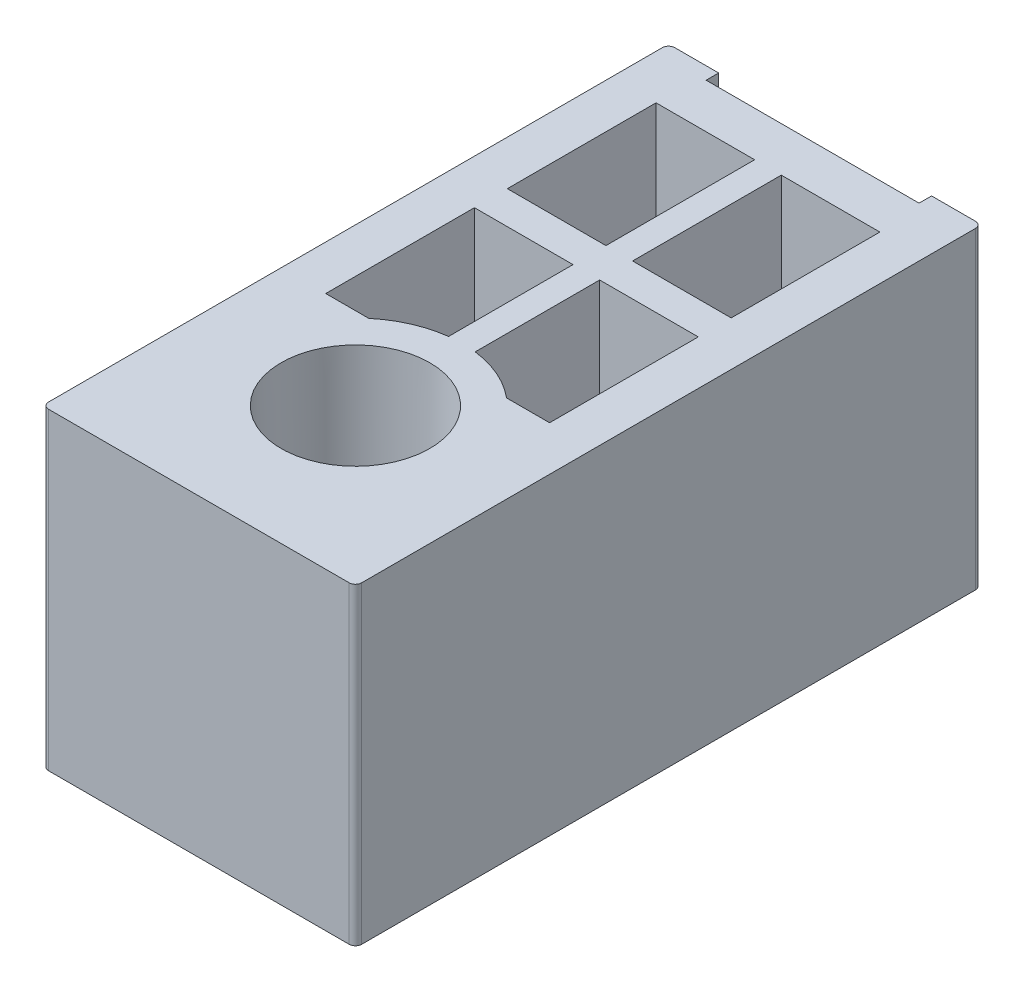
ISO-10303-21;
HEADER;
FILE_DESCRIPTION(('STEP AP214'),'2;1');
FILE_NAME('part.step','',(''),(''),'','','');
FILE_SCHEMA(('AUTOMOTIVE_DESIGN { 1 0 10303 214 1 1 1 1 }'));
ENDSEC;
DATA;
#1=APPLICATION_CONTEXT('core data for automotive mechanical design processes');
#2=APPLICATION_PROTOCOL_DEFINITION('international standard','automotive_design',2000,#1);
#3=PRODUCT_CONTEXT('',#1,'mechanical');
#4=PRODUCT('Part','Part','',(#3));
#5=PRODUCT_RELATED_PRODUCT_CATEGORY('part','',(#4));
#6=PRODUCT_DEFINITION_FORMATION('','',#4);
#7=PRODUCT_DEFINITION_CONTEXT('part definition',#1,'design');
#8=PRODUCT_DEFINITION('design','',#6,#7);
#9=PRODUCT_DEFINITION_SHAPE('','',#8);
#10=(LENGTH_UNIT() NAMED_UNIT(*) SI_UNIT(.MILLI.,.METRE.));
#11=(NAMED_UNIT(*) PLANE_ANGLE_UNIT() SI_UNIT($,.RADIAN.));
#12=(NAMED_UNIT(*) SI_UNIT($,.STERADIAN.) SOLID_ANGLE_UNIT());
#13=UNCERTAINTY_MEASURE_WITH_UNIT(LENGTH_MEASURE(1.E-05),#10,'distance_accuracy_value','');
#14=(GEOMETRIC_REPRESENTATION_CONTEXT(3) GLOBAL_UNCERTAINTY_ASSIGNED_CONTEXT((#13)) GLOBAL_UNIT_ASSIGNED_CONTEXT((#10,
#11,#12)) REPRESENTATION_CONTEXT('',''));
#15=CARTESIAN_POINT('',(0.,0.,0.));
#16=DIRECTION('',(0.,0.,1.));
#17=DIRECTION('',(1.,0.,0.));
#18=AXIS2_PLACEMENT_3D('',#15,#16,#17);
#19=CARTESIAN_POINT('',(4.,25.,-49.));
#20=DIRECTION('',(-1.,0.,0.));
#21=DIRECTION('',(0.,0.,1.));
#22=AXIS2_PLACEMENT_3D('',#19,#20,#21);
#23=PLANE('',#22);
#24=DIRECTION('',(0.,0.,-1.));
#25=VECTOR('',#24,1.);
#26=CARTESIAN_POINT('',(4.,0.,-49.));
#27=LINE('',#26,#25);
#28=CARTESIAN_POINT('',(4.,0.,-49.));
#29=VERTEX_POINT('',#28);
#30=CARTESIAN_POINT('',(4.,0.,-50.));
#31=VERTEX_POINT('',#30);
#32=EDGE_CURVE('E437',#29,#31,#27,.T.);
#33=ORIENTED_EDGE('',*,*,#32,.T.);
#34=DIRECTION('',(0.,-1.,0.));
#35=VECTOR('',#34,1.);
#36=CARTESIAN_POINT('',(4.,25.,-50.));
#37=LINE('',#36,#35);
#38=CARTESIAN_POINT('',(4.,25.,-50.));
#39=VERTEX_POINT('',#38);
#40=EDGE_CURVE('E11',#39,#31,#37,.T.);
#41=ORIENTED_EDGE('',*,*,#40,.F.);
#42=DIRECTION('',(0.,0.,-1.));
#43=VECTOR('',#42,1.);
#44=CARTESIAN_POINT('',(4.,25.,-49.));
#45=LINE('',#44,#43);
#46=CARTESIAN_POINT('',(4.,25.,-49.));
#47=VERTEX_POINT('',#46);
#48=EDGE_CURVE('E466',#47,#39,#45,.T.);
#49=ORIENTED_EDGE('',*,*,#48,.F.);
#50=DIRECTION('',(0.,-1.,0.));
#51=VECTOR('',#50,1.);
#52=CARTESIAN_POINT('',(4.,25.,-49.));
#53=LINE('',#52,#51);
#54=EDGE_CURVE('E490',#47,#29,#53,.T.);
#55=ORIENTED_EDGE('',*,*,#54,.T.);
#56=EDGE_LOOP('',(#33,#41,#49,#55));
#57=FACE_BOUND('',#56,.T.);
#58=ADVANCED_FACE('F26',(#57),#23,.F.);
#59=CARTESIAN_POINT('',(0.500000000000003,25.,-50.));
#60=DIRECTION('',(0.,0.,1.));
#61=DIRECTION('',(1.,0.,0.));
#62=AXIS2_PLACEMENT_3D('',#59,#60,#61);
#63=PLANE('',#62);
#64=DIRECTION('',(-1.,0.,0.));
#65=VECTOR('',#64,1.);
#66=CARTESIAN_POINT('',(0.500000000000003,0.,-50.));
#67=LINE('',#66,#65);
#68=CARTESIAN_POINT('',(0.500000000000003,0.,-50.));
#69=VERTEX_POINT('',#68);
#70=EDGE_CURVE('E428',#31,#69,#67,.T.);
#71=ORIENTED_EDGE('',*,*,#70,.T.);
#72=DIRECTION('',(0.,-1.,0.));
#73=VECTOR('',#72,1.);
#74=CARTESIAN_POINT('',(0.500000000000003,25.,-50.));
#75=LINE('',#74,#73);
#76=CARTESIAN_POINT('',(0.500000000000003,25.,-50.));
#77=VERTEX_POINT('',#76);
#78=EDGE_CURVE('E33',#77,#69,#75,.T.);
#79=ORIENTED_EDGE('',*,*,#78,.F.);
#80=DIRECTION('',(-1.,0.,0.));
#81=VECTOR('',#80,1.);
#82=CARTESIAN_POINT('',(0.500000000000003,25.,-50.));
#83=LINE('',#82,#81);
#84=EDGE_CURVE('E469',#39,#77,#83,.T.);
#85=ORIENTED_EDGE('',*,*,#84,.F.);
#86=ORIENTED_EDGE('',*,*,#40,.T.);
#87=EDGE_LOOP('',(#71,#79,#85,#86));
#88=FACE_BOUND('',#87,.T.);
#89=ADVANCED_FACE('F419',(#88),#63,.F.);
#90=CARTESIAN_POINT('',(0.5,25.,-49.5));
#91=DIRECTION('',(0.,-1.,0.));
#92=DIRECTION('',(0.,0.,-1.));
#93=AXIS2_PLACEMENT_3D('',#90,#91,#92);
#94=CYLINDRICAL_SURFACE('',#93,0.5);
#95=CARTESIAN_POINT('',(0.5,0.,-49.5));
#96=DIRECTION('',(0.,1.,0.));
#97=DIRECTION('',(0.,0.,1.));
#98=AXIS2_PLACEMENT_3D('',#95,#96,#97);
#99=CIRCLE('',#98,0.5);
#100=CARTESIAN_POINT('',(0.,0.,-49.5));
#101=VERTEX_POINT('',#100);
#102=EDGE_CURVE('E436',#69,#101,#99,.T.);
#103=ORIENTED_EDGE('',*,*,#102,.T.);
#104=DIRECTION('',(0.,-1.,0.));
#105=VECTOR('',#104,1.);
#106=CARTESIAN_POINT('',(0.,25.,-49.5));
#107=LINE('',#106,#105);
#108=CARTESIAN_POINT('',(0.,25.,-49.5));
#109=VERTEX_POINT('',#108);
#110=EDGE_CURVE('E442',#109,#101,#107,.T.);
#111=ORIENTED_EDGE('',*,*,#110,.F.);
#112=CARTESIAN_POINT('',(0.5,25.,-49.5));
#113=DIRECTION('',(0.,1.,0.));
#114=DIRECTION('',(0.,0.,1.));
#115=AXIS2_PLACEMENT_3D('',#112,#113,#114);
#116=CIRCLE('',#115,0.5);
#117=EDGE_CURVE('E441',#77,#109,#116,.T.);
#118=ORIENTED_EDGE('',*,*,#117,.F.);
#119=ORIENTED_EDGE('',*,*,#78,.T.);
#120=EDGE_LOOP('',(#103,#111,#118,#119));
#121=FACE_BOUND('',#120,.T.);
#122=ADVANCED_FACE('F416',(#121),#94,.T.);
#123=CARTESIAN_POINT('',(0.,25.,-49.5));
#124=DIRECTION('',(1.,0.,0.));
#125=DIRECTION('',(0.,0.,-1.));
#126=AXIS2_PLACEMENT_3D('',#123,#124,#125);
#127=PLANE('',#126);
#128=DIRECTION('',(0.,0.,1.));
#129=VECTOR('',#128,1.);
#130=CARTESIAN_POINT('',(0.,0.,-49.5));
#131=LINE('',#130,#129);
#132=CARTESIAN_POINT('',(0.,0.,-0.500000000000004));
#133=VERTEX_POINT('',#132);
#134=EDGE_CURVE('E445',#101,#133,#131,.T.);
#135=ORIENTED_EDGE('',*,*,#134,.T.);
#136=DIRECTION('',(0.,-1.,0.));
#137=VECTOR('',#136,1.);
#138=CARTESIAN_POINT('',(0.,25.,-0.500000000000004));
#139=LINE('',#138,#137);
#140=CARTESIAN_POINT('',(0.,25.,-0.500000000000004));
#141=VERTEX_POINT('',#140);
#142=EDGE_CURVE('E514',#141,#133,#139,.T.);
#143=ORIENTED_EDGE('',*,*,#142,.F.);
#144=DIRECTION('',(0.,0.,1.));
#145=VECTOR('',#144,1.);
#146=CARTESIAN_POINT('',(0.,25.,-49.5));
#147=LINE('',#146,#145);
#148=EDGE_CURVE('E472',#109,#141,#147,.T.);
#149=ORIENTED_EDGE('',*,*,#148,.F.);
#150=ORIENTED_EDGE('',*,*,#110,.T.);
#151=EDGE_LOOP('',(#135,#143,#149,#150));
#152=FACE_BOUND('',#151,.T.);
#153=ADVANCED_FACE('F412',(#152),#127,.F.);
#154=CARTESIAN_POINT('',(0.5,25.,-0.5));
#155=DIRECTION('',(0.,-1.,0.));
#156=DIRECTION('',(0.,0.,-1.));
#157=AXIS2_PLACEMENT_3D('',#154,#155,#156);
#158=CYLINDRICAL_SURFACE('',#157,0.5);
#159=CARTESIAN_POINT('',(0.5,0.,-0.5));
#160=DIRECTION('',(0.,1.,0.));
#161=DIRECTION('',(0.,0.,1.));
#162=AXIS2_PLACEMENT_3D('',#159,#160,#161);
#163=CIRCLE('',#162,0.5);
#164=CARTESIAN_POINT('',(0.500000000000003,0.,0.));
#165=VERTEX_POINT('',#164);
#166=EDGE_CURVE('E447',#133,#165,#163,.T.);
#167=ORIENTED_EDGE('',*,*,#166,.T.);
#168=DIRECTION('',(0.,-1.,0.));
#169=VECTOR('',#168,1.);
#170=CARTESIAN_POINT('',(0.500000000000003,25.,0.));
#171=LINE('',#170,#169);
#172=CARTESIAN_POINT('',(0.500000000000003,25.,0.));
#173=VERTEX_POINT('',#172);
#174=EDGE_CURVE('E511',#173,#165,#171,.T.);
#175=ORIENTED_EDGE('',*,*,#174,.F.);
#176=CARTESIAN_POINT('',(0.5,25.,-0.5));
#177=DIRECTION('',(0.,1.,0.));
#178=DIRECTION('',(0.,0.,1.));
#179=AXIS2_PLACEMENT_3D('',#176,#177,#178);
#180=CIRCLE('',#179,0.5);
#181=EDGE_CURVE('E474',#141,#173,#180,.T.);
#182=ORIENTED_EDGE('',*,*,#181,.F.);
#183=ORIENTED_EDGE('',*,*,#142,.T.);
#184=EDGE_LOOP('',(#167,#175,#182,#183));
#185=FACE_BOUND('',#184,.T.);
#186=ADVANCED_FACE('F408',(#185),#158,.T.);
#187=CARTESIAN_POINT('',(0.500000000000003,25.,0.));
#188=DIRECTION('',(0.,0.,-1.));
#189=DIRECTION('',(-1.,0.,0.));
#190=AXIS2_PLACEMENT_3D('',#187,#188,#189);
#191=PLANE('',#190);
#192=DIRECTION('',(1.,0.,0.));
#193=VECTOR('',#192,1.);
#194=CARTESIAN_POINT('',(0.500000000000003,0.,0.));
#195=LINE('',#194,#193);
#196=CARTESIAN_POINT('',(24.5,0.,0.));
#197=VERTEX_POINT('',#196);
#198=EDGE_CURVE('E452',#165,#197,#195,.T.);
#199=ORIENTED_EDGE('',*,*,#198,.T.);
#200=DIRECTION('',(0.,-1.,0.));
#201=VECTOR('',#200,1.);
#202=CARTESIAN_POINT('',(24.5,25.,0.));
#203=LINE('',#202,#201);
#204=CARTESIAN_POINT('',(24.5,25.,0.));
#205=VERTEX_POINT('',#204);
#206=EDGE_CURVE('E508',#205,#197,#203,.T.);
#207=ORIENTED_EDGE('',*,*,#206,.F.);
#208=DIRECTION('',(1.,0.,0.));
#209=VECTOR('',#208,1.);
#210=CARTESIAN_POINT('',(0.500000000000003,25.,0.));
#211=LINE('',#210,#209);
#212=EDGE_CURVE('E476',#173,#205,#211,.T.);
#213=ORIENTED_EDGE('',*,*,#212,.F.);
#214=ORIENTED_EDGE('',*,*,#174,.T.);
#215=EDGE_LOOP('',(#199,#207,#213,#214));
#216=FACE_BOUND('',#215,.T.);
#217=ADVANCED_FACE('F404',(#216),#191,.F.);
#218=CARTESIAN_POINT('',(24.5,25.,-0.5));
#219=DIRECTION('',(0.,-1.,0.));
#220=DIRECTION('',(0.,0.,-1.));
#221=AXIS2_PLACEMENT_3D('',#218,#219,#220);
#222=CYLINDRICAL_SURFACE('',#221,0.5);
#223=CARTESIAN_POINT('',(24.5,0.,-0.5));
#224=DIRECTION('',(0.,1.,0.));
#225=DIRECTION('',(0.,0.,1.));
#226=AXIS2_PLACEMENT_3D('',#223,#224,#225);
#227=CIRCLE('',#226,0.5);
#228=CARTESIAN_POINT('',(25.,0.,-0.500000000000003));
#229=VERTEX_POINT('',#228);
#230=EDGE_CURVE('E454',#197,#229,#227,.T.);
#231=ORIENTED_EDGE('',*,*,#230,.T.);
#232=DIRECTION('',(0.,-1.,0.));
#233=VECTOR('',#232,1.);
#234=CARTESIAN_POINT('',(25.,25.,-0.500000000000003));
#235=LINE('',#234,#233);
#236=CARTESIAN_POINT('',(25.,25.,-0.500000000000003));
#237=VERTEX_POINT('',#236);
#238=EDGE_CURVE('E505',#237,#229,#235,.T.);
#239=ORIENTED_EDGE('',*,*,#238,.F.);
#240=CARTESIAN_POINT('',(24.5,25.,-0.5));
#241=DIRECTION('',(0.,1.,0.));
#242=DIRECTION('',(0.,0.,1.));
#243=AXIS2_PLACEMENT_3D('',#240,#241,#242);
#244=CIRCLE('',#243,0.5);
#245=EDGE_CURVE('E478',#205,#237,#244,.T.);
#246=ORIENTED_EDGE('',*,*,#245,.F.);
#247=ORIENTED_EDGE('',*,*,#206,.T.);
#248=EDGE_LOOP('',(#231,#239,#246,#247));
#249=FACE_BOUND('',#248,.T.);
#250=ADVANCED_FACE('F400',(#249),#222,.T.);
#251=CARTESIAN_POINT('',(25.,25.,-49.5));
#252=DIRECTION('',(-1.,0.,0.));
#253=DIRECTION('',(0.,0.,1.));
#254=AXIS2_PLACEMENT_3D('',#251,#252,#253);
#255=PLANE('',#254);
#256=DIRECTION('',(0.,0.,-1.));
#257=VECTOR('',#256,1.);
#258=CARTESIAN_POINT('',(25.,0.,-49.5));
#259=LINE('',#258,#257);
#260=CARTESIAN_POINT('',(25.,0.,-49.5));
#261=VERTEX_POINT('',#260);
#262=EDGE_CURVE('E456',#229,#261,#259,.T.);
#263=ORIENTED_EDGE('',*,*,#262,.T.);
#264=DIRECTION('',(0.,-1.,0.));
#265=VECTOR('',#264,1.);
#266=CARTESIAN_POINT('',(25.,25.,-49.5));
#267=LINE('',#266,#265);
#268=CARTESIAN_POINT('',(25.,25.,-49.5));
#269=VERTEX_POINT('',#268);
#270=EDGE_CURVE('E502',#269,#261,#267,.T.);
#271=ORIENTED_EDGE('',*,*,#270,.F.);
#272=DIRECTION('',(0.,0.,-1.));
#273=VECTOR('',#272,1.);
#274=CARTESIAN_POINT('',(25.,25.,-49.5));
#275=LINE('',#274,#273);
#276=EDGE_CURVE('E480',#237,#269,#275,.T.);
#277=ORIENTED_EDGE('',*,*,#276,.F.);
#278=ORIENTED_EDGE('',*,*,#238,.T.);
#279=EDGE_LOOP('',(#263,#271,#277,#278));
#280=FACE_BOUND('',#279,.T.);
#281=ADVANCED_FACE('F396',(#280),#255,.F.);
#282=CARTESIAN_POINT('',(24.5,25.,-49.5));
#283=DIRECTION('',(0.,-1.,0.));
#284=DIRECTION('',(0.,0.,-1.));
#285=AXIS2_PLACEMENT_3D('',#282,#283,#284);
#286=CYLINDRICAL_SURFACE('',#285,0.5);
#287=CARTESIAN_POINT('',(24.5,0.,-49.5));
#288=DIRECTION('',(0.,1.,0.));
#289=DIRECTION('',(0.,0.,-1.));
#290=AXIS2_PLACEMENT_3D('',#287,#288,#289);
#291=CIRCLE('',#290,0.5);
#292=CARTESIAN_POINT('',(24.5,0.,-50.));
#293=VERTEX_POINT('',#292);
#294=EDGE_CURVE('E458',#261,#293,#291,.T.);
#295=ORIENTED_EDGE('',*,*,#294,.T.);
#296=DIRECTION('',(0.,-1.,0.));
#297=VECTOR('',#296,1.);
#298=CARTESIAN_POINT('',(24.5,25.,-50.));
#299=LINE('',#298,#297);
#300=CARTESIAN_POINT('',(24.5,25.,-50.));
#301=VERTEX_POINT('',#300);
#302=EDGE_CURVE('E499',#301,#293,#299,.T.);
#303=ORIENTED_EDGE('',*,*,#302,.F.);
#304=CARTESIAN_POINT('',(24.5,25.,-49.5));
#305=DIRECTION('',(0.,1.,0.));
#306=DIRECTION('',(0.,0.,-1.));
#307=AXIS2_PLACEMENT_3D('',#304,#305,#306);
#308=CIRCLE('',#307,0.5);
#309=EDGE_CURVE('E482',#269,#301,#308,.T.);
#310=ORIENTED_EDGE('',*,*,#309,.F.);
#311=ORIENTED_EDGE('',*,*,#270,.T.);
#312=EDGE_LOOP('',(#295,#303,#310,#311));
#313=FACE_BOUND('',#312,.T.);
#314=ADVANCED_FACE('F392',(#313),#286,.T.);
#315=CARTESIAN_POINT('',(21.,25.,-50.));
#316=DIRECTION('',(0.,0.,1.));
#317=DIRECTION('',(1.,0.,0.));
#318=AXIS2_PLACEMENT_3D('',#315,#316,#317);
#319=PLANE('',#318);
#320=DIRECTION('',(-1.,0.,0.));
#321=VECTOR('',#320,1.);
#322=CARTESIAN_POINT('',(21.,0.,-50.));
#323=LINE('',#322,#321);
#324=CARTESIAN_POINT('',(21.,0.,-50.));
#325=VERTEX_POINT('',#324);
#326=EDGE_CURVE('E460',#293,#325,#323,.T.);
#327=ORIENTED_EDGE('',*,*,#326,.T.);
#328=DIRECTION('',(0.,-1.,0.));
#329=VECTOR('',#328,1.);
#330=CARTESIAN_POINT('',(21.,25.,-50.));
#331=LINE('',#330,#329);
#332=CARTESIAN_POINT('',(21.,25.,-50.));
#333=VERTEX_POINT('',#332);
#334=EDGE_CURVE('E496',#333,#325,#331,.T.);
#335=ORIENTED_EDGE('',*,*,#334,.F.);
#336=DIRECTION('',(-1.,0.,0.));
#337=VECTOR('',#336,1.);
#338=CARTESIAN_POINT('',(21.,25.,-50.));
#339=LINE('',#338,#337);
#340=EDGE_CURVE('E484',#301,#333,#339,.T.);
#341=ORIENTED_EDGE('',*,*,#340,.F.);
#342=ORIENTED_EDGE('',*,*,#302,.T.);
#343=EDGE_LOOP('',(#327,#335,#341,#342));
#344=FACE_BOUND('',#343,.T.);
#345=ADVANCED_FACE('F388',(#344),#319,.F.);
#346=CARTESIAN_POINT('',(21.,25.,-49.));
#347=DIRECTION('',(1.,0.,0.));
#348=DIRECTION('',(0.,0.,-1.));
#349=AXIS2_PLACEMENT_3D('',#346,#347,#348);
#350=PLANE('',#349);
#351=DIRECTION('',(0.,0.,1.));
#352=VECTOR('',#351,1.);
#353=CARTESIAN_POINT('',(21.,0.,-49.));
#354=LINE('',#353,#352);
#355=CARTESIAN_POINT('',(21.,0.,-49.));
#356=VERTEX_POINT('',#355);
#357=EDGE_CURVE('E462',#325,#356,#354,.T.);
#358=ORIENTED_EDGE('',*,*,#357,.T.);
#359=DIRECTION('',(0.,-1.,0.));
#360=VECTOR('',#359,1.);
#361=CARTESIAN_POINT('',(21.,25.,-49.));
#362=LINE('',#361,#360);
#363=CARTESIAN_POINT('',(21.,25.,-49.));
#364=VERTEX_POINT('',#363);
#365=EDGE_CURVE('E493',#364,#356,#362,.T.);
#366=ORIENTED_EDGE('',*,*,#365,.F.);
#367=DIRECTION('',(0.,0.,1.));
#368=VECTOR('',#367,1.);
#369=CARTESIAN_POINT('',(21.,25.,-49.));
#370=LINE('',#369,#368);
#371=EDGE_CURVE('E486',#333,#364,#370,.T.);
#372=ORIENTED_EDGE('',*,*,#371,.F.);
#373=ORIENTED_EDGE('',*,*,#334,.T.);
#374=EDGE_LOOP('',(#358,#366,#372,#373));
#375=FACE_BOUND('',#374,.T.);
#376=ADVANCED_FACE('F384',(#375),#350,.F.);
#377=CARTESIAN_POINT('',(4.,25.,-49.));
#378=DIRECTION('',(0.,0.,1.));
#379=DIRECTION('',(1.,0.,0.));
#380=AXIS2_PLACEMENT_3D('',#377,#378,#379);
#381=PLANE('',#380);
#382=DIRECTION('',(-1.,0.,0.));
#383=VECTOR('',#382,1.);
#384=CARTESIAN_POINT('',(4.,0.,-49.));
#385=LINE('',#384,#383);
#386=EDGE_CURVE('E464',#356,#29,#385,.T.);
#387=ORIENTED_EDGE('',*,*,#386,.T.);
#388=ORIENTED_EDGE('',*,*,#54,.F.);
#389=DIRECTION('',(-1.,0.,0.));
#390=VECTOR('',#389,1.);
#391=CARTESIAN_POINT('',(4.,25.,-49.));
#392=LINE('',#391,#390);
#393=EDGE_CURVE('E488',#364,#47,#392,.T.);
#394=ORIENTED_EDGE('',*,*,#393,.F.);
#395=ORIENTED_EDGE('',*,*,#365,.T.);
#396=EDGE_LOOP('',(#387,#388,#394,#395));
#397=FACE_BOUND('',#396,.T.);
#398=ADVANCED_FACE('F380',(#397),#381,.F.);
#399=CARTESIAN_POINT('',(0.5,25.,-49.5));
#400=DIRECTION('',(0.,1.,0.));
#401=DIRECTION('',(0.,0.,1.));
#402=AXIS2_PLACEMENT_3D('',#399,#400,#401);
#403=PLANE('',#402);
#404=DIRECTION('',(1.,0.,0.));
#405=VECTOR('',#404,1.);
#406=CARTESIAN_POINT('',(21.,25.,-45.4363766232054));
#407=LINE('',#406,#405);
#408=CARTESIAN_POINT('',(13.5636233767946,25.,-45.4363766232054));
#409=VERTEX_POINT('',#408);
#410=CARTESIAN_POINT('',(21.4363766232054,25.,-45.4363766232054));
#411=VERTEX_POINT('',#410);
#412=EDGE_CURVE('E242',#409,#411,#407,.T.);
#413=ORIENTED_EDGE('',*,*,#412,.T.);
#414=DIRECTION('',(0.,0.,1.));
#415=VECTOR('',#414,1.);
#416=CARTESIAN_POINT('',(21.4363766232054,25.,-45.));
#417=LINE('',#416,#415);
#418=CARTESIAN_POINT('',(21.4363766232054,25.,-33.5636233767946));
#419=VERTEX_POINT('',#418);
#420=EDGE_CURVE('E254',#411,#419,#417,.T.);
#421=ORIENTED_EDGE('',*,*,#420,.T.);
#422=DIRECTION('',(-1.,0.,0.));
#423=VECTOR('',#422,1.);
#424=CARTESIAN_POINT('',(21.,25.,-33.5636233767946));
#425=LINE('',#424,#423);
#426=CARTESIAN_POINT('',(13.5636233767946,25.,-33.5636233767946));
#427=VERTEX_POINT('',#426);
#428=EDGE_CURVE('E40',#419,#427,#425,.T.);
#429=ORIENTED_EDGE('',*,*,#428,.T.);
#430=DIRECTION('',(0.,0.,-1.));
#431=VECTOR('',#430,1.);
#432=CARTESIAN_POINT('',(13.5636233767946,25.,-45.));
#433=LINE('',#432,#431);
#434=EDGE_CURVE('E249',#427,#409,#433,.T.);
#435=ORIENTED_EDGE('',*,*,#434,.T.);
#436=EDGE_LOOP('',(#413,#421,#429,#435));
#437=FACE_BOUND('',#436,.T.);
#438=CARTESIAN_POINT('',(12.5,25.,-12.5));
#439=DIRECTION('',(0.,-1.,0.));
#440=DIRECTION('',(0.,0.,-1.));
#441=AXIS2_PLACEMENT_3D('',#438,#439,#440);
#442=CIRCLE('',#441,5.93637662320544);
#443=CARTESIAN_POINT('',(12.5,25.,-18.4363766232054));
#444=VERTEX_POINT('',#443);
#445=EDGE_CURVE('E261',#444,#444,#442,.T.);
#446=ORIENTED_EDGE('',*,*,#445,.T.);
#447=EDGE_LOOP('',(#446));
#448=FACE_BOUND('',#447,.T.);
#449=DIRECTION('',(0.,0.,1.));
#450=VECTOR('',#449,1.);
#451=CARTESIAN_POINT('',(21.4363766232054,25.,-12.5));
#452=LINE('',#451,#450);
#453=CARTESIAN_POINT('',(21.4363766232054,25.,-30.9363766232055));
#454=VERTEX_POINT('',#453);
#455=CARTESIAN_POINT('',(21.4363766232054,25.,-19.0636233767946));
#456=VERTEX_POINT('',#455);
#457=EDGE_CURVE('E278',#454,#456,#452,.T.);
#458=ORIENTED_EDGE('',*,*,#457,.T.);
#459=DIRECTION('',(-1.,0.,0.));
#460=VECTOR('',#459,1.);
#461=CARTESIAN_POINT('',(12.5,25.,-19.0636233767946));
#462=LINE('',#461,#460);
#463=CARTESIAN_POINT('',(18.0004084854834,25.,-19.0636233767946));
#464=VERTEX_POINT('',#463);
#465=EDGE_CURVE('E591',#456,#464,#462,.T.);
#466=ORIENTED_EDGE('',*,*,#465,.T.);
#467=CARTESIAN_POINT('',(12.5,25.,-12.5));
#468=DIRECTION('',(0.,-1.,0.));
#469=DIRECTION('',(0.,0.,-1.));
#470=AXIS2_PLACEMENT_3D('',#467,#468,#469);
#471=CIRCLE('',#470,8.56362337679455);
#472=CARTESIAN_POINT('',(13.5636233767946,25.,-20.9973143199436));
#473=VERTEX_POINT('',#472);
#474=EDGE_CURVE('E594',#464,#473,#471,.F.);
#475=ORIENTED_EDGE('',*,*,#474,.T.);
#476=DIRECTION('',(0.,0.,-1.));
#477=VECTOR('',#476,1.);
#478=CARTESIAN_POINT('',(13.5636233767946,25.,-12.5));
#479=LINE('',#478,#477);
#480=CARTESIAN_POINT('',(13.5636233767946,25.,-30.9363766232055));
#481=VERTEX_POINT('',#480);
#482=EDGE_CURVE('E597',#473,#481,#479,.T.);
#483=ORIENTED_EDGE('',*,*,#482,.T.);
#484=DIRECTION('',(1.,0.,0.));
#485=VECTOR('',#484,1.);
#486=CARTESIAN_POINT('',(12.5,25.,-30.9363766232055));
#487=LINE('',#486,#485);
#488=EDGE_CURVE('E287',#481,#454,#487,.T.);
#489=ORIENTED_EDGE('',*,*,#488,.T.);
#490=EDGE_LOOP('',(#458,#466,#475,#483,#489));
#491=FACE_BOUND('',#490,.T.);
#492=DIRECTION('',(0.,0.,-1.));
#493=VECTOR('',#492,1.);
#494=CARTESIAN_POINT('',(3.56362337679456,25.,-12.5));
#495=LINE('',#494,#493);
#496=CARTESIAN_POINT('',(3.56362337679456,25.,-19.0636233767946));
#497=VERTEX_POINT('',#496);
#498=CARTESIAN_POINT('',(3.56362337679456,25.,-30.9363766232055));
#499=VERTEX_POINT('',#498);
#500=EDGE_CURVE('E345',#497,#499,#495,.T.);
#501=ORIENTED_EDGE('',*,*,#500,.T.);
#502=DIRECTION('',(1.,0.,0.));
#503=VECTOR('',#502,1.);
#504=CARTESIAN_POINT('',(12.5,25.,-30.9363766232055));
#505=LINE('',#504,#503);
#506=CARTESIAN_POINT('',(11.4363766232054,25.,-30.9363766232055));
#507=VERTEX_POINT('',#506);
#508=EDGE_CURVE('E559',#499,#507,#505,.T.);
#509=ORIENTED_EDGE('',*,*,#508,.T.);
#510=DIRECTION('',(0.,0.,1.));
#511=VECTOR('',#510,1.);
#512=CARTESIAN_POINT('',(11.4363766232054,25.,-12.5));
#513=LINE('',#512,#511);
#514=CARTESIAN_POINT('',(11.4363766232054,25.,-20.9973143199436));
#515=VERTEX_POINT('',#514);
#516=EDGE_CURVE('E562',#507,#515,#513,.T.);
#517=ORIENTED_EDGE('',*,*,#516,.T.);
#518=CARTESIAN_POINT('',(12.5,25.,-12.5));
#519=DIRECTION('',(0.,-1.,0.));
#520=DIRECTION('',(0.,0.,-1.));
#521=AXIS2_PLACEMENT_3D('',#518,#519,#520);
#522=CIRCLE('',#521,8.56362337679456);
#523=CARTESIAN_POINT('',(6.99959151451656,25.,-19.0636233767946));
#524=VERTEX_POINT('',#523);
#525=EDGE_CURVE('E565',#515,#524,#522,.F.);
#526=ORIENTED_EDGE('',*,*,#525,.T.);
#527=DIRECTION('',(-1.,0.,0.));
#528=VECTOR('',#527,1.);
#529=CARTESIAN_POINT('',(12.5,25.,-19.0636233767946));
#530=LINE('',#529,#528);
#531=EDGE_CURVE('E567',#524,#497,#530,.T.);
#532=ORIENTED_EDGE('',*,*,#531,.T.);
#533=EDGE_LOOP('',(#501,#509,#517,#526,#532));
#534=FACE_BOUND('',#533,.T.);
#535=DIRECTION('',(0.,0.,-1.));
#536=VECTOR('',#535,1.);
#537=CARTESIAN_POINT('',(3.56362337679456,25.,-45.));
#538=LINE('',#537,#536);
#539=CARTESIAN_POINT('',(3.56362337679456,25.,-33.5636233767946));
#540=VERTEX_POINT('',#539);
#541=CARTESIAN_POINT('',(3.56362337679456,25.,-45.4363766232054));
#542=VERTEX_POINT('',#541);
#543=EDGE_CURVE('E534',#540,#542,#538,.T.);
#544=ORIENTED_EDGE('',*,*,#543,.T.);
#545=DIRECTION('',(1.,0.,0.));
#546=VECTOR('',#545,1.);
#547=CARTESIAN_POINT('',(4.,25.,-45.4363766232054));
#548=LINE('',#547,#546);
#549=CARTESIAN_POINT('',(11.4363766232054,25.,-45.4363766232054));
#550=VERTEX_POINT('',#549);
#551=EDGE_CURVE('E530',#542,#550,#548,.T.);
#552=ORIENTED_EDGE('',*,*,#551,.T.);
#553=DIRECTION('',(0.,0.,1.));
#554=VECTOR('',#553,1.);
#555=CARTESIAN_POINT('',(11.4363766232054,25.,-45.));
#556=LINE('',#555,#554);
#557=CARTESIAN_POINT('',(11.4363766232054,25.,-33.5636233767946));
#558=VERTEX_POINT('',#557);
#559=EDGE_CURVE('E533',#550,#558,#556,.T.);
#560=ORIENTED_EDGE('',*,*,#559,.T.);
#561=DIRECTION('',(-1.,0.,0.));
#562=VECTOR('',#561,1.);
#563=CARTESIAN_POINT('',(4.,25.,-33.5636233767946));
#564=LINE('',#563,#562);
#565=EDGE_CURVE('E537',#558,#540,#564,.T.);
#566=ORIENTED_EDGE('',*,*,#565,.T.);
#567=EDGE_LOOP('',(#544,#552,#560,#566));
#568=FACE_BOUND('',#567,.T.);
#569=ORIENTED_EDGE('',*,*,#48,.T.);
#570=ORIENTED_EDGE('',*,*,#84,.T.);
#571=ORIENTED_EDGE('',*,*,#117,.T.);
#572=ORIENTED_EDGE('',*,*,#148,.T.);
#573=ORIENTED_EDGE('',*,*,#181,.T.);
#574=ORIENTED_EDGE('',*,*,#212,.T.);
#575=ORIENTED_EDGE('',*,*,#245,.T.);
#576=ORIENTED_EDGE('',*,*,#276,.T.);
#577=ORIENTED_EDGE('',*,*,#309,.T.);
#578=ORIENTED_EDGE('',*,*,#340,.T.);
#579=ORIENTED_EDGE('',*,*,#371,.T.);
#580=ORIENTED_EDGE('',*,*,#393,.T.);
#581=EDGE_LOOP('',(#569,#570,#571,#572,#573,#574,#575,#576,#577,#578,#579,#580));
#582=FACE_BOUND('',#581,.T.);
#583=ADVANCED_FACE('F377',(#437,#448,#491,#534,#568,#582),#403,.T.);
#584=CARTESIAN_POINT('',(0.5,0.,-49.5));
#585=DIRECTION('',(0.,1.,0.));
#586=DIRECTION('',(0.,0.,1.));
#587=AXIS2_PLACEMENT_3D('',#584,#585,#586);
#588=PLANE('',#587);
#589=DIRECTION('',(0.,0.,1.));
#590=VECTOR('',#589,1.);
#591=CARTESIAN_POINT('',(21.,0.,-45.));
#592=LINE('',#591,#590);
#593=CARTESIAN_POINT('',(21.,0.,-45.));
#594=VERTEX_POINT('',#593);
#595=CARTESIAN_POINT('',(21.,0.,-34.));
#596=VERTEX_POINT('',#595);
#597=EDGE_CURVE('E233',#594,#596,#592,.T.);
#598=ORIENTED_EDGE('',*,*,#597,.F.);
#599=DIRECTION('',(1.,0.,0.));
#600=VECTOR('',#599,1.);
#601=CARTESIAN_POINT('',(21.,0.,-45.));
#602=LINE('',#601,#600);
#603=CARTESIAN_POINT('',(14.,0.,-45.));
#604=VERTEX_POINT('',#603);
#605=EDGE_CURVE('E48',#604,#594,#602,.T.);
#606=ORIENTED_EDGE('',*,*,#605,.F.);
#607=DIRECTION('',(0.,0.,-1.));
#608=VECTOR('',#607,1.);
#609=CARTESIAN_POINT('',(14.,0.,-45.));
#610=LINE('',#609,#608);
#611=CARTESIAN_POINT('',(14.,0.,-34.));
#612=VERTEX_POINT('',#611);
#613=EDGE_CURVE('E240',#612,#604,#610,.T.);
#614=ORIENTED_EDGE('',*,*,#613,.F.);
#615=DIRECTION('',(-1.,0.,0.));
#616=VECTOR('',#615,1.);
#617=CARTESIAN_POINT('',(21.,0.,-34.));
#618=LINE('',#617,#616);
#619=EDGE_CURVE('E224',#596,#612,#618,.T.);
#620=ORIENTED_EDGE('',*,*,#619,.F.);
#621=EDGE_LOOP('',(#598,#606,#614,#620));
#622=FACE_BOUND('',#621,.T.);
#623=CARTESIAN_POINT('',(12.5,0.,-12.5));
#624=DIRECTION('',(0.,-1.,0.));
#625=DIRECTION('',(0.,0.,-1.));
#626=AXIS2_PLACEMENT_3D('',#623,#624,#625);
#627=CIRCLE('',#626,5.5);
#628=CARTESIAN_POINT('',(12.5,0.,-18.));
#629=VERTEX_POINT('',#628);
#630=EDGE_CURVE('E248',#629,#629,#627,.T.);
#631=ORIENTED_EDGE('',*,*,#630,.F.);
#632=EDGE_LOOP('',(#631));
#633=FACE_BOUND('',#632,.T.);
#634=DIRECTION('',(-1.,0.,0.));
#635=VECTOR('',#634,1.);
#636=CARTESIAN_POINT('',(21.,0.,-19.5));
#637=LINE('',#636,#635);
#638=CARTESIAN_POINT('',(21.,0.,-19.5));
#639=VERTEX_POINT('',#638);
#640=CARTESIAN_POINT('',(18.1568542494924,0.,-19.5));
#641=VERTEX_POINT('',#640);
#642=EDGE_CURVE('E266',#639,#641,#637,.T.);
#643=ORIENTED_EDGE('',*,*,#642,.F.);
#644=DIRECTION('',(0.,0.,1.));
#645=VECTOR('',#644,1.);
#646=CARTESIAN_POINT('',(21.,0.,-30.5));
#647=LINE('',#646,#645);
#648=CARTESIAN_POINT('',(21.,0.,-30.5));
#649=VERTEX_POINT('',#648);
#650=EDGE_CURVE('E264',#649,#639,#647,.T.);
#651=ORIENTED_EDGE('',*,*,#650,.F.);
#652=DIRECTION('',(1.,0.,0.));
#653=VECTOR('',#652,1.);
#654=CARTESIAN_POINT('',(21.,0.,-30.5));
#655=LINE('',#654,#653);
#656=CARTESIAN_POINT('',(14.,0.,-30.5));
#657=VERTEX_POINT('',#656);
#658=EDGE_CURVE('E275',#657,#649,#655,.T.);
#659=ORIENTED_EDGE('',*,*,#658,.F.);
#660=DIRECTION('',(0.,0.,-1.));
#661=VECTOR('',#660,1.);
#662=CARTESIAN_POINT('',(14.,0.,-21.3741196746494));
#663=LINE('',#662,#661);
#664=CARTESIAN_POINT('',(14.,0.,-21.3741196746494));
#665=VERTEX_POINT('',#664);
#666=EDGE_CURVE('E272',#665,#657,#663,.T.);
#667=ORIENTED_EDGE('',*,*,#666,.F.);
#668=CARTESIAN_POINT('',(12.5,0.,-12.5));
#669=DIRECTION('',(0.,1.,0.));
#670=DIRECTION('',(0.,0.,-1.));
#671=AXIS2_PLACEMENT_3D('',#668,#669,#670);
#672=CIRCLE('',#671,9.);
#673=EDGE_CURVE('E269',#641,#665,#672,.T.);
#674=ORIENTED_EDGE('',*,*,#673,.F.);
#675=EDGE_LOOP('',(#643,#651,#659,#667,#674));
#676=FACE_BOUND('',#675,.T.);
#677=DIRECTION('',(1.,0.,0.));
#678=VECTOR('',#677,1.);
#679=CARTESIAN_POINT('',(4.,0.,-30.5));
#680=LINE('',#679,#678);
#681=CARTESIAN_POINT('',(4.,0.,-30.5));
#682=VERTEX_POINT('',#681);
#683=CARTESIAN_POINT('',(11.,0.,-30.5));
#684=VERTEX_POINT('',#683);
#685=EDGE_CURVE('E588',#682,#684,#680,.T.);
#686=ORIENTED_EDGE('',*,*,#685,.F.);
#687=DIRECTION('',(0.,0.,-1.));
#688=VECTOR('',#687,1.);
#689=CARTESIAN_POINT('',(4.,0.,-30.5));
#690=LINE('',#689,#688);
#691=CARTESIAN_POINT('',(4.,0.,-19.5));
#692=VERTEX_POINT('',#691);
#693=EDGE_CURVE('E281',#692,#682,#690,.T.);
#694=ORIENTED_EDGE('',*,*,#693,.F.);
#695=DIRECTION('',(-1.,0.,0.));
#696=VECTOR('',#695,1.);
#697=CARTESIAN_POINT('',(4.,0.,-19.5));
#698=LINE('',#697,#696);
#699=CARTESIAN_POINT('',(6.84314575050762,0.,-19.5));
#700=VERTEX_POINT('',#699);
#701=EDGE_CURVE('E579',#700,#692,#698,.T.);
#702=ORIENTED_EDGE('',*,*,#701,.F.);
#703=CARTESIAN_POINT('',(12.5,0.,-12.5));
#704=DIRECTION('',(0.,1.,0.));
#705=DIRECTION('',(0.,0.,-1.));
#706=AXIS2_PLACEMENT_3D('',#703,#704,#705);
#707=CIRCLE('',#706,9.);
#708=CARTESIAN_POINT('',(11.,0.,-21.3741196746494));
#709=VERTEX_POINT('',#708);
#710=EDGE_CURVE('E582',#709,#700,#707,.T.);
#711=ORIENTED_EDGE('',*,*,#710,.F.);
#712=DIRECTION('',(0.,0.,1.));
#713=VECTOR('',#712,1.);
#714=CARTESIAN_POINT('',(11.,0.,-21.3741196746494));
#715=LINE('',#714,#713);
#716=EDGE_CURVE('E585',#684,#709,#715,.T.);
#717=ORIENTED_EDGE('',*,*,#716,.F.);
#718=EDGE_LOOP('',(#686,#694,#702,#711,#717));
#719=FACE_BOUND('',#718,.T.);
#720=DIRECTION('',(1.,0.,0.));
#721=VECTOR('',#720,1.);
#722=CARTESIAN_POINT('',(4.,0.,-45.));
#723=LINE('',#722,#721);
#724=CARTESIAN_POINT('',(4.,0.,-45.));
#725=VERTEX_POINT('',#724);
#726=CARTESIAN_POINT('',(11.,0.,-45.));
#727=VERTEX_POINT('',#726);
#728=EDGE_CURVE('E554',#725,#727,#723,.T.);
#729=ORIENTED_EDGE('',*,*,#728,.F.);
#730=DIRECTION('',(0.,0.,-1.));
#731=VECTOR('',#730,1.);
#732=CARTESIAN_POINT('',(4.,0.,-45.));
#733=LINE('',#732,#731);
#734=CARTESIAN_POINT('',(4.,0.,-34.));
#735=VERTEX_POINT('',#734);
#736=EDGE_CURVE('E557',#735,#725,#733,.T.);
#737=ORIENTED_EDGE('',*,*,#736,.F.);
#738=DIRECTION('',(-1.,0.,0.));
#739=VECTOR('',#738,1.);
#740=CARTESIAN_POINT('',(4.,0.,-34.));
#741=LINE('',#740,#739);
#742=CARTESIAN_POINT('',(11.,0.,-34.));
#743=VERTEX_POINT('',#742);
#744=EDGE_CURVE('E543',#743,#735,#741,.T.);
#745=ORIENTED_EDGE('',*,*,#744,.F.);
#746=DIRECTION('',(0.,0.,1.));
#747=VECTOR('',#746,1.);
#748=CARTESIAN_POINT('',(11.,0.,-45.));
#749=LINE('',#748,#747);
#750=EDGE_CURVE('E551',#727,#743,#749,.T.);
#751=ORIENTED_EDGE('',*,*,#750,.F.);
#752=EDGE_LOOP('',(#729,#737,#745,#751));
#753=FACE_BOUND('',#752,.T.);
#754=ORIENTED_EDGE('',*,*,#32,.F.);
#755=ORIENTED_EDGE('',*,*,#386,.F.);
#756=ORIENTED_EDGE('',*,*,#357,.F.);
#757=ORIENTED_EDGE('',*,*,#326,.F.);
#758=ORIENTED_EDGE('',*,*,#294,.F.);
#759=ORIENTED_EDGE('',*,*,#262,.F.);
#760=ORIENTED_EDGE('',*,*,#230,.F.);
#761=ORIENTED_EDGE('',*,*,#198,.F.);
#762=ORIENTED_EDGE('',*,*,#166,.F.);
#763=ORIENTED_EDGE('',*,*,#134,.F.);
#764=ORIENTED_EDGE('',*,*,#102,.F.);
#765=ORIENTED_EDGE('',*,*,#70,.F.);
#766=EDGE_LOOP('',(#754,#755,#756,#757,#758,#759,#760,#761,#762,#763,#764,#765));
#767=FACE_BOUND('',#766,.T.);
#768=ADVANCED_FACE('F237',(#622,#633,#676,#719,#753,#767),#588,.F.);
#769=CARTESIAN_POINT('',(4.,0.,-45.));
#770=DIRECTION('',(-0.999847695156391,-0.0174524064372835,0.));
#771=DIRECTION('',(0.0174524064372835,-0.999847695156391,0.));
#772=AXIS2_PLACEMENT_3D('',#769,#770,#771);
#773=PLANE('',#772);
#774=ORIENTED_EDGE('',*,*,#736,.T.);
#775=DIRECTION('',(0.0174497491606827,-0.999695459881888,0.0174497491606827));
#776=VECTOR('',#775,1.);
#777=CARTESIAN_POINT('',(4.,0.,-45.));
#778=LINE('',#777,#776);
#779=EDGE_CURVE('E540',#542,#725,#778,.T.);
#780=ORIENTED_EDGE('',*,*,#779,.F.);
#781=ORIENTED_EDGE('',*,*,#543,.F.);
#782=DIRECTION('',(0.0174497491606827,-0.999695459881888,-0.0174497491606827));
#783=VECTOR('',#782,1.);
#784=CARTESIAN_POINT('',(4.,0.,-34.));
#785=LINE('',#784,#783);
#786=EDGE_CURVE('E526',#540,#735,#785,.T.);
#787=ORIENTED_EDGE('',*,*,#786,.T.);
#788=EDGE_LOOP('',(#774,#780,#781,#787));
#789=FACE_BOUND('',#788,.T.);
#790=ADVANCED_FACE('F360',(#789),#773,.F.);
#791=CARTESIAN_POINT('',(4.,0.,-34.));
#792=DIRECTION('',(0.,-0.0174524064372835,0.999847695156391));
#793=DIRECTION('',(0.,-0.999847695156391,-0.0174524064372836));
#794=AXIS2_PLACEMENT_3D('',#791,#792,#793);
#795=PLANE('',#794);
#796=ORIENTED_EDGE('',*,*,#744,.T.);
#797=ORIENTED_EDGE('',*,*,#786,.F.);
#798=ORIENTED_EDGE('',*,*,#565,.F.);
#799=DIRECTION('',(-0.0174497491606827,-0.999695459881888,-0.0174497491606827));
#800=VECTOR('',#799,1.);
#801=CARTESIAN_POINT('',(10.9966505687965,-0.191888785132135,-34.0033494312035));
#802=LINE('',#801,#800);
#803=EDGE_CURVE('E527',#558,#743,#802,.T.);
#804=ORIENTED_EDGE('',*,*,#803,.T.);
#805=EDGE_LOOP('',(#796,#797,#798,#804));
#806=FACE_BOUND('',#805,.T.);
#807=ADVANCED_FACE('F363',(#806),#795,.F.);
#808=CARTESIAN_POINT('',(11.,0.,-45.));
#809=DIRECTION('',(0.999847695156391,-0.0174524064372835,0.));
#810=DIRECTION('',(0.0174524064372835,0.999847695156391,0.));
#811=AXIS2_PLACEMENT_3D('',#808,#809,#810);
#812=PLANE('',#811);
#813=ORIENTED_EDGE('',*,*,#750,.T.);
#814=ORIENTED_EDGE('',*,*,#803,.F.);
#815=ORIENTED_EDGE('',*,*,#559,.F.);
#816=DIRECTION('',(-0.0174497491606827,-0.999695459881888,0.0174497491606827));
#817=VECTOR('',#816,1.);
#818=CARTESIAN_POINT('',(10.9978685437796,-0.122111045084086,-44.9978685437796));
#819=LINE('',#818,#817);
#820=EDGE_CURVE('E545',#550,#727,#819,.T.);
#821=ORIENTED_EDGE('',*,*,#820,.T.);
#822=EDGE_LOOP('',(#813,#814,#815,#821));
#823=FACE_BOUND('',#822,.T.);
#824=ADVANCED_FACE('F367',(#823),#812,.F.);
#825=CARTESIAN_POINT('',(4.,0.,-45.));
#826=DIRECTION('',(0.,-0.0174524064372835,-0.999847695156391));
#827=DIRECTION('',(0.,0.999847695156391,-0.0174524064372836));
#828=AXIS2_PLACEMENT_3D('',#825,#826,#827);
#829=PLANE('',#828);
#830=ORIENTED_EDGE('',*,*,#728,.T.);
#831=ORIENTED_EDGE('',*,*,#820,.F.);
#832=ORIENTED_EDGE('',*,*,#551,.F.);
#833=ORIENTED_EDGE('',*,*,#779,.T.);
#834=EDGE_LOOP('',(#830,#831,#832,#833));
#835=FACE_BOUND('',#834,.T.);
#836=ADVANCED_FACE('F355',(#835),#829,.F.);
#837=CARTESIAN_POINT('',(4.,0.,-30.5));
#838=DIRECTION('',(-0.999847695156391,-0.0174524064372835,0.));
#839=DIRECTION('',(0.0174524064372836,-0.999847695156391,0.));
#840=AXIS2_PLACEMENT_3D('',#837,#838,#839);
#841=PLANE('',#840);
#842=ORIENTED_EDGE('',*,*,#693,.T.);
#843=DIRECTION('',(0.0174497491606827,-0.999695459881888,0.0174497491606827));
#844=VECTOR('',#843,1.);
#845=CARTESIAN_POINT('',(4.,0.,-30.5));
#846=LINE('',#845,#844);
#847=EDGE_CURVE('E569',#499,#682,#846,.T.);
#848=ORIENTED_EDGE('',*,*,#847,.F.);
#849=ORIENTED_EDGE('',*,*,#500,.F.);
#850=DIRECTION('',(0.0174497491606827,-0.999695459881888,-0.0174497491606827));
#851=VECTOR('',#850,1.);
#852=CARTESIAN_POINT('',(4.,0.,-19.5));
#853=LINE('',#852,#851);
#854=EDGE_CURVE('E344',#497,#692,#853,.T.);
#855=ORIENTED_EDGE('',*,*,#854,.T.);
#856=EDGE_LOOP('',(#842,#848,#849,#855));
#857=FACE_BOUND('',#856,.T.);
#858=ADVANCED_FACE('F351',(#857),#841,.F.);
#859=CARTESIAN_POINT('',(4.,0.,-19.5));
#860=DIRECTION('',(0.,-0.0174524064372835,0.999847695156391));
#861=DIRECTION('',(0.,-0.999847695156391,-0.0174524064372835));
#862=AXIS2_PLACEMENT_3D('',#859,#860,#861);
#863=PLANE('',#862);
#864=ORIENTED_EDGE('',*,*,#701,.T.);
#865=ORIENTED_EDGE('',*,*,#854,.F.);
#866=ORIENTED_EDGE('',*,*,#531,.F.);
#867=CARTESIAN_POINT('',(6.99959151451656,25.,-19.0636233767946));
#868=CARTESIAN_POINT('',(6.96399404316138,19.3898133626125,-19.1615495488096));
#869=CARTESIAN_POINT('',(6.92872635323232,13.7796246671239,-19.2594757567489));
#870=CARTESIAN_POINT('',(6.87682984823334,5.44628976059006,-19.404934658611));
#871=CARTESIAN_POINT('',(6.85994895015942,2.72314512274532,-19.4524673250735));
#872=CARTESIAN_POINT('',(6.84314575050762,0.,-19.5));
#873=B_SPLINE_CURVE_WITH_KNOTS('',3,(#867,#868,#869,#870,#871,#872),.UNSPECIFIED.,.F.,.F.,(4,2,
4),(0.,16.8334623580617,25.0042976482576),.UNSPECIFIED.);
#874=EDGE_CURVE('E337',#524,#700,#873,.T.);
#875=ORIENTED_EDGE('',*,*,#874,.T.);
#876=EDGE_LOOP('',(#864,#865,#866,#875));
#877=FACE_BOUND('',#876,.T.);
#878=ADVANCED_FACE('F347',(#877),#863,.F.);
#879=CARTESIAN_POINT('',(12.5,0.,-12.5));
#880=DIRECTION('',(0.,-1.,0.));
#881=DIRECTION('',(0.,0.,-1.));
#882=AXIS2_PLACEMENT_3D('',#879,#880,#881);
#883=CONICAL_SURFACE('',#882,9.,0.0174532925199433);
#884=ORIENTED_EDGE('',*,*,#710,.T.);
#885=ORIENTED_EDGE('',*,*,#874,.F.);
#886=ORIENTED_EDGE('',*,*,#525,.F.);
#887=CARTESIAN_POINT('',(11.4363766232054,25.,-20.9973143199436));
#888=CARTESIAN_POINT('',(11.3874183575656,22.1951828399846,-21.0405259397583));
#889=CARTESIAN_POINT('',(11.3384600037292,19.3903606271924,-21.0834089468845));
#890=CARTESIAN_POINT('',(11.240543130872,13.7807067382,-21.1685447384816));
#891=CARTESIAN_POINT('',(11.1915846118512,10.975875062,-21.2107975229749));
#892=CARTESIAN_POINT('',(11.0950840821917,5.44736342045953,-21.2934859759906));
#893=CARTESIAN_POINT('',(11.0475420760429,2.72368371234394,-21.3339388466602));
#894=CARTESIAN_POINT('',(11.,0.,-21.3741196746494));
#895=B_SPLINE_CURVE_WITH_KNOTS('',3,(#887,#888,#889,#890,#891,#892,#893,#894),.UNSPECIFIED.,.F.,
.F.,(4,2,2,4),(0.,8.41673158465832,16.8334628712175,25.0066476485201),.UNSPECIFIED.);
#896=EDGE_CURVE('E331',#515,#709,#895,.T.);
#897=ORIENTED_EDGE('',*,*,#896,.T.);
#898=EDGE_LOOP('',(#884,#885,#886,#897));
#899=FACE_BOUND('',#898,.T.);
#900=ADVANCED_FACE('F326',(#899),#883,.T.);
#901=CARTESIAN_POINT('',(11.,0.,-21.3741196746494));
#902=DIRECTION('',(0.999847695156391,-0.0174524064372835,0.));
#903=DIRECTION('',(0.0174524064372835,0.999847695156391,0.));
#904=AXIS2_PLACEMENT_3D('',#901,#902,#903);
#905=PLANE('',#904);
#906=ORIENTED_EDGE('',*,*,#716,.T.);
#907=ORIENTED_EDGE('',*,*,#896,.F.);
#908=ORIENTED_EDGE('',*,*,#516,.F.);
#909=DIRECTION('',(-0.0174497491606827,-0.999695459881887,0.0174497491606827));
#910=VECTOR('',#909,1.);
#911=CARTESIAN_POINT('',(10.9978685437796,-0.122111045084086,-30.4978685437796));
#912=LINE('',#911,#910);
#913=EDGE_CURVE('E338',#507,#684,#912,.T.);
#914=ORIENTED_EDGE('',*,*,#913,.T.);
#915=EDGE_LOOP('',(#906,#907,#908,#914));
#916=FACE_BOUND('',#915,.T.);
#917=ADVANCED_FACE('F322',(#916),#905,.F.);
#918=CARTESIAN_POINT('',(4.,0.,-30.5));
#919=DIRECTION('',(0.,-0.0174524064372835,-0.999847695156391));
#920=DIRECTION('',(0.,0.999847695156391,-0.0174524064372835));
#921=AXIS2_PLACEMENT_3D('',#918,#919,#920);
#922=PLANE('',#921);
#923=ORIENTED_EDGE('',*,*,#685,.T.);
#924=ORIENTED_EDGE('',*,*,#913,.F.);
#925=ORIENTED_EDGE('',*,*,#508,.F.);
#926=ORIENTED_EDGE('',*,*,#847,.T.);
#927=EDGE_LOOP('',(#923,#924,#925,#926));
#928=FACE_BOUND('',#927,.T.);
#929=ADVANCED_FACE('F317',(#928),#922,.F.);
#930=CARTESIAN_POINT('',(21.,0.,-30.5));
#931=DIRECTION('',(0.999847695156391,-0.0174524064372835,0.));
#932=DIRECTION('',(0.0174524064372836,0.999847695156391,0.));
#933=AXIS2_PLACEMENT_3D('',#930,#931,#932);
#934=PLANE('',#933);
#935=ORIENTED_EDGE('',*,*,#650,.T.);
#936=DIRECTION('',(-0.0174497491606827,-0.999695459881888,-0.0174497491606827));
#937=VECTOR('',#936,1.);
#938=CARTESIAN_POINT('',(20.9966505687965,-0.191888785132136,-19.5033494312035));
#939=LINE('',#938,#937);
#940=EDGE_CURVE('E283',#456,#639,#939,.T.);
#941=ORIENTED_EDGE('',*,*,#940,.F.);
#942=ORIENTED_EDGE('',*,*,#457,.F.);
#943=DIRECTION('',(-0.0174497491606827,-0.999695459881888,0.0174497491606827));
#944=VECTOR('',#943,1.);
#945=CARTESIAN_POINT('',(21.,0.,-30.5));
#946=LINE('',#945,#944);
#947=EDGE_CURVE('E279',#454,#649,#946,.T.);
#948=ORIENTED_EDGE('',*,*,#947,.T.);
#949=EDGE_LOOP('',(#935,#941,#942,#948));
#950=FACE_BOUND('',#949,.T.);
#951=ADVANCED_FACE('F314',(#950),#934,.F.);
#952=CARTESIAN_POINT('',(21.,0.,-30.5));
#953=DIRECTION('',(0.,-0.0174524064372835,-0.999847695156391));
#954=DIRECTION('',(0.,0.999847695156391,-0.0174524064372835));
#955=AXIS2_PLACEMENT_3D('',#952,#953,#954);
#956=PLANE('',#955);
#957=ORIENTED_EDGE('',*,*,#658,.T.);
#958=ORIENTED_EDGE('',*,*,#947,.F.);
#959=ORIENTED_EDGE('',*,*,#488,.F.);
#960=DIRECTION('',(0.0174497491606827,-0.999695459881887,0.0174497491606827));
#961=VECTOR('',#960,1.);
#962=CARTESIAN_POINT('',(14.0027787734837,-0.15919582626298,-30.4972212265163));
#963=LINE('',#962,#961);
#964=EDGE_CURVE('E282',#481,#657,#963,.T.);
#965=ORIENTED_EDGE('',*,*,#964,.T.);
#966=EDGE_LOOP('',(#957,#958,#959,#965));
#967=FACE_BOUND('',#966,.T.);
#968=ADVANCED_FACE('F312',(#967),#956,.F.);
#969=CARTESIAN_POINT('',(14.,0.,-21.3741196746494));
#970=DIRECTION('',(-0.999847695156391,-0.0174524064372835,0.));
#971=DIRECTION('',(0.0174524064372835,-0.999847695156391,0.));
#972=AXIS2_PLACEMENT_3D('',#969,#970,#971);
#973=PLANE('',#972);
#974=ORIENTED_EDGE('',*,*,#666,.T.);
#975=ORIENTED_EDGE('',*,*,#964,.F.);
#976=ORIENTED_EDGE('',*,*,#482,.F.);
#977=CARTESIAN_POINT('',(13.5636233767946,25.,-20.9973143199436));
#978=CARTESIAN_POINT('',(13.6125816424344,22.1951828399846,-21.0405259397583));
#979=CARTESIAN_POINT('',(13.6615399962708,19.3903606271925,-21.0834089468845));
#980=CARTESIAN_POINT('',(13.759456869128,13.7807067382,-21.1685447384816));
#981=CARTESIAN_POINT('',(13.8084153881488,10.975875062,-21.2107975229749));
#982=CARTESIAN_POINT('',(13.9049159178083,5.44736342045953,-21.2934859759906));
#983=CARTESIAN_POINT('',(13.9524579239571,2.72368371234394,-21.3339388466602));
#984=CARTESIAN_POINT('',(14.,0.,-21.3741196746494));
#985=B_SPLINE_CURVE_WITH_KNOTS('',3,(#977,#978,#979,#980,#981,#982,#983,#984),.UNSPECIFIED.,.F.,
.F.,(4,2,2,4),(0.,8.41673158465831,16.8334628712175,25.0066476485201),.UNSPECIFIED.);
#986=EDGE_CURVE('E294',#473,#665,#985,.T.);
#987=ORIENTED_EDGE('',*,*,#986,.T.);
#988=EDGE_LOOP('',(#974,#975,#976,#987));
#989=FACE_BOUND('',#988,.T.);
#990=ADVANCED_FACE('F306',(#989),#973,.F.);
#991=CARTESIAN_POINT('',(12.5,0.,-12.5));
#992=DIRECTION('',(0.,-1.,0.));
#993=DIRECTION('',(0.,0.,-1.));
#994=AXIS2_PLACEMENT_3D('',#991,#992,#993);
#995=CONICAL_SURFACE('',#994,9.,0.0174532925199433);
#996=ORIENTED_EDGE('',*,*,#673,.T.);
#997=ORIENTED_EDGE('',*,*,#986,.F.);
#998=ORIENTED_EDGE('',*,*,#474,.F.);
#999=CARTESIAN_POINT('',(18.0004084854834,25.,-19.0636233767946));
#1000=CARTESIAN_POINT('',(18.0360059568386,19.3898133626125,-19.1615495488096));
#1001=CARTESIAN_POINT('',(18.0712736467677,13.7796246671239,-19.2594757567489));
#1002=CARTESIAN_POINT('',(18.1231701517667,5.44628976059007,-19.404934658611));
#1003=CARTESIAN_POINT('',(18.1400510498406,2.72314512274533,-19.4524673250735));
#1004=CARTESIAN_POINT('',(18.1568542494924,0.,-19.5));
#1005=B_SPLINE_CURVE_WITH_KNOTS('',3,(#999,#1000,#1001,#1002,#1003,#1004),.UNSPECIFIED.,.F.,.F.,
(4,2,4),(0.,16.8334623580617,25.0042976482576),.UNSPECIFIED.);
#1006=EDGE_CURVE('E286',#464,#641,#1005,.T.);
#1007=ORIENTED_EDGE('',*,*,#1006,.T.);
#1008=EDGE_LOOP('',(#996,#997,#998,#1007));
#1009=FACE_BOUND('',#1008,.T.);
#1010=ADVANCED_FACE('F303',(#1009),#995,.T.);
#1011=CARTESIAN_POINT('',(21.,0.,-19.5));
#1012=DIRECTION('',(0.,-0.0174524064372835,0.999847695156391));
#1013=DIRECTION('',(0.,-0.999847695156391,-0.0174524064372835));
#1014=AXIS2_PLACEMENT_3D('',#1011,#1012,#1013);
#1015=PLANE('',#1014);
#1016=ORIENTED_EDGE('',*,*,#642,.T.);
#1017=ORIENTED_EDGE('',*,*,#1006,.F.);
#1018=ORIENTED_EDGE('',*,*,#465,.F.);
#1019=ORIENTED_EDGE('',*,*,#940,.T.);
#1020=EDGE_LOOP('',(#1016,#1017,#1018,#1019));
#1021=FACE_BOUND('',#1020,.T.);
#1022=ADVANCED_FACE('F300',(#1021),#1015,.F.);
#1023=CARTESIAN_POINT('',(12.5,0.,-12.5));
#1024=DIRECTION('',(0.,1.,0.));
#1025=DIRECTION('',(0.,0.,-1.));
#1026=AXIS2_PLACEMENT_3D('',#1023,#1024,#1025);
#1027=CONICAL_SURFACE('',#1026,5.5,0.0174532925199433);
#1028=ORIENTED_EDGE('',*,*,#445,.F.);
#1029=EDGE_LOOP('',(#1028));
#1030=FACE_BOUND('',#1029,.T.);
#1031=ORIENTED_EDGE('',*,*,#630,.T.);
#1032=EDGE_LOOP('',(#1031));
#1033=FACE_BOUND('',#1032,.T.);
#1034=ADVANCED_FACE('F618',(#1030,#1033),#1027,.F.);
#1035=CARTESIAN_POINT('',(21.,0.,-45.));
#1036=DIRECTION('',(0.,-0.0174524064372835,-0.999847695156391));
#1037=DIRECTION('',(0.,0.999847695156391,-0.0174524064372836));
#1038=AXIS2_PLACEMENT_3D('',#1035,#1036,#1037);
#1039=PLANE('',#1038);
#1040=ORIENTED_EDGE('',*,*,#605,.T.);
#1041=DIRECTION('',(-0.0174497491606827,-0.999695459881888,0.0174497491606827));
#1042=VECTOR('',#1041,1.);
#1043=CARTESIAN_POINT('',(21.,0.,-45.));
#1044=LINE('',#1043,#1042);
#1045=EDGE_CURVE('E230',#411,#594,#1044,.T.);
#1046=ORIENTED_EDGE('',*,*,#1045,.F.);
#1047=ORIENTED_EDGE('',*,*,#412,.F.);
#1048=DIRECTION('',(0.0174497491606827,-0.999695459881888,0.0174497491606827));
#1049=VECTOR('',#1048,1.);
#1050=CARTESIAN_POINT('',(14.,0.,-45.));
#1051=LINE('',#1050,#1049);
#1052=EDGE_CURVE('E246',#409,#604,#1051,.T.);
#1053=ORIENTED_EDGE('',*,*,#1052,.T.);
#1054=EDGE_LOOP('',(#1040,#1046,#1047,#1053));
#1055=FACE_BOUND('',#1054,.T.);
#1056=ADVANCED_FACE('F622',(#1055),#1039,.F.);
#1057=CARTESIAN_POINT('',(14.,0.,-45.));
#1058=DIRECTION('',(-0.999847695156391,-0.0174524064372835,0.));
#1059=DIRECTION('',(0.0174524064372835,-0.999847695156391,0.));
#1060=AXIS2_PLACEMENT_3D('',#1057,#1058,#1059);
#1061=PLANE('',#1060);
#1062=ORIENTED_EDGE('',*,*,#613,.T.);
#1063=ORIENTED_EDGE('',*,*,#1052,.F.);
#1064=ORIENTED_EDGE('',*,*,#434,.F.);
#1065=DIRECTION('',(0.0174497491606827,-0.999695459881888,-0.0174497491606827));
#1066=VECTOR('',#1065,1.);
#1067=CARTESIAN_POINT('',(14.0021314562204,-0.122111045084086,-34.0021314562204));
#1068=LINE('',#1067,#1066);
#1069=EDGE_CURVE('E229',#427,#612,#1068,.T.);
#1070=ORIENTED_EDGE('',*,*,#1069,.T.);
#1071=EDGE_LOOP('',(#1062,#1063,#1064,#1070));
#1072=FACE_BOUND('',#1071,.T.);
#1073=ADVANCED_FACE('F627',(#1072),#1061,.F.);
#1074=CARTESIAN_POINT('',(21.,0.,-34.));
#1075=DIRECTION('',(0.,-0.0174524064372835,0.999847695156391));
#1076=DIRECTION('',(0.,-0.999847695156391,-0.0174524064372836));
#1077=AXIS2_PLACEMENT_3D('',#1074,#1075,#1076);
#1078=PLANE('',#1077);
#1079=ORIENTED_EDGE('',*,*,#619,.T.);
#1080=ORIENTED_EDGE('',*,*,#1069,.F.);
#1081=ORIENTED_EDGE('',*,*,#428,.F.);
#1082=DIRECTION('',(-0.0174497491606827,-0.999695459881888,-0.0174497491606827));
#1083=VECTOR('',#1082,1.);
#1084=CARTESIAN_POINT('',(20.9966505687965,-0.191888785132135,-34.0033494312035));
#1085=LINE('',#1084,#1083);
#1086=EDGE_CURVE('E220',#419,#596,#1085,.T.);
#1087=ORIENTED_EDGE('',*,*,#1086,.T.);
#1088=EDGE_LOOP('',(#1079,#1080,#1081,#1087));
#1089=FACE_BOUND('',#1088,.T.);
#1090=ADVANCED_FACE('F222',(#1089),#1078,.F.);
#1091=CARTESIAN_POINT('',(21.,0.,-45.));
#1092=DIRECTION('',(0.999847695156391,-0.0174524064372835,0.));
#1093=DIRECTION('',(0.0174524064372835,0.999847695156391,0.));
#1094=AXIS2_PLACEMENT_3D('',#1091,#1092,#1093);
#1095=PLANE('',#1094);
#1096=ORIENTED_EDGE('',*,*,#597,.T.);
#1097=ORIENTED_EDGE('',*,*,#1086,.F.);
#1098=ORIENTED_EDGE('',*,*,#420,.F.);
#1099=ORIENTED_EDGE('',*,*,#1045,.T.);
#1100=EDGE_LOOP('',(#1096,#1097,#1098,#1099));
#1101=FACE_BOUND('',#1100,.T.);
#1102=ADVANCED_FACE('F234',(#1101),#1095,.F.);
#1103=CLOSED_SHELL('',(#58,#89,#122,#153,#186,#217,#250,#281,#314,#345,#376,#398,#583,#768,#790,
#807,#824,#836,#858,#878,#900,#917,#929,#951,#968,#990,#1010,#1022,#1034,#1056,#1073,#1090,#1102));
#1104=MANIFOLD_SOLID_BREP('B2',#1103);
#1105=ADVANCED_BREP_SHAPE_REPRESENTATION('',(#18,#1104),#14);
#1106=SHAPE_DEFINITION_REPRESENTATION(#9,#1105);
ENDSEC;
END-ISO-10303-21;
